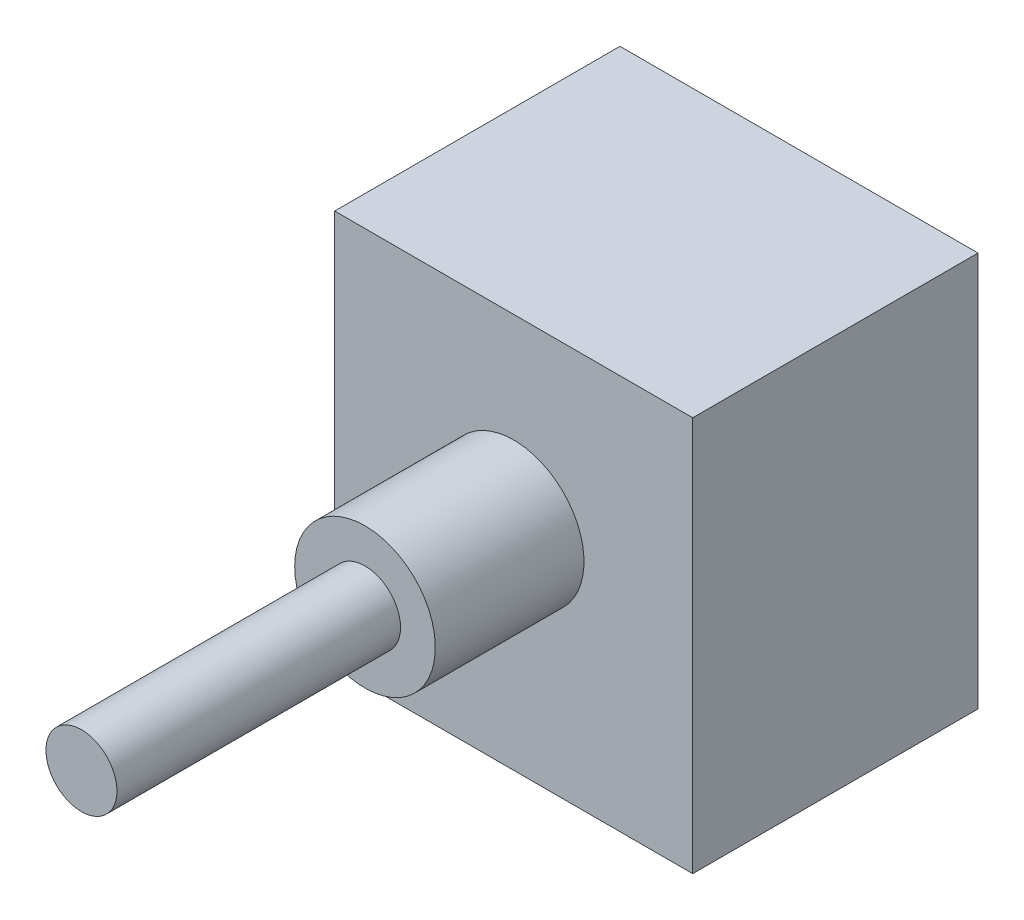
ISO-10303-21;
HEADER;
FILE_DESCRIPTION(('STEP AP214'),'2;1');
FILE_NAME('part.step','',(''),(''),'','','');
FILE_SCHEMA(('AUTOMOTIVE_DESIGN { 1 0 10303 214 1 1 1 1 }'));
ENDSEC;
DATA;
#1=APPLICATION_CONTEXT('core data for automotive mechanical design processes');
#2=APPLICATION_PROTOCOL_DEFINITION('international standard','automotive_design',2000,#1);
#3=PRODUCT_CONTEXT('',#1,'mechanical');
#4=PRODUCT('Part','Part','',(#3));
#5=PRODUCT_RELATED_PRODUCT_CATEGORY('part','',(#4));
#6=PRODUCT_DEFINITION_FORMATION('','',#4);
#7=PRODUCT_DEFINITION_CONTEXT('part definition',#1,'design');
#8=PRODUCT_DEFINITION('design','',#6,#7);
#9=PRODUCT_DEFINITION_SHAPE('','',#8);
#10=(LENGTH_UNIT() NAMED_UNIT(*) SI_UNIT(.MILLI.,.METRE.));
#11=(NAMED_UNIT(*) PLANE_ANGLE_UNIT() SI_UNIT($,.RADIAN.));
#12=(NAMED_UNIT(*) SI_UNIT($,.STERADIAN.) SOLID_ANGLE_UNIT());
#13=UNCERTAINTY_MEASURE_WITH_UNIT(LENGTH_MEASURE(1.E-05),#10,'distance_accuracy_value','');
#14=(GEOMETRIC_REPRESENTATION_CONTEXT(3) GLOBAL_UNCERTAINTY_ASSIGNED_CONTEXT((#13)) GLOBAL_UNIT_ASSIGNED_CONTEXT((#10,
#11,#12)) REPRESENTATION_CONTEXT('',''));
#15=CARTESIAN_POINT('',(0.,0.,0.));
#16=DIRECTION('',(0.,0.,1.));
#17=DIRECTION('',(1.,0.,0.));
#18=AXIS2_PLACEMENT_3D('',#15,#16,#17);
#19=CARTESIAN_POINT('',(-7.90575,-8.71855,12.5984));
#20=DIRECTION('',(1.,0.,0.));
#21=DIRECTION('',(0.,0.,-1.));
#22=AXIS2_PLACEMENT_3D('',#19,#20,#21);
#23=PLANE('',#22);
#24=DIRECTION('',(0.,-1.,0.));
#25=VECTOR('',#24,1.);
#26=CARTESIAN_POINT('',(-7.90575,-8.71855,0.));
#27=LINE('',#26,#25);
#28=CARTESIAN_POINT('',(-7.90575,8.71855,0.));
#29=VERTEX_POINT('',#28);
#30=CARTESIAN_POINT('',(-7.90575,-8.71855,0.));
#31=VERTEX_POINT('',#30);
#32=EDGE_CURVE('E98',#29,#31,#27,.T.);
#33=ORIENTED_EDGE('',*,*,#32,.T.);
#34=DIRECTION('',(0.,0.,-1.));
#35=VECTOR('',#34,1.);
#36=CARTESIAN_POINT('',(-7.90575,-8.71855,12.5984));
#37=LINE('',#36,#35);
#38=CARTESIAN_POINT('',(-7.90575,-8.71855,12.5984));
#39=VERTEX_POINT('',#38);
#40=EDGE_CURVE('E40',#39,#31,#37,.T.);
#41=ORIENTED_EDGE('',*,*,#40,.F.);
#42=DIRECTION('',(0.,-1.,0.));
#43=VECTOR('',#42,1.);
#44=CARTESIAN_POINT('',(-7.90575,-8.71855,12.5984));
#45=LINE('',#44,#43);
#46=CARTESIAN_POINT('',(-7.90575,8.71855,12.5984));
#47=VERTEX_POINT('',#46);
#48=EDGE_CURVE('E84',#47,#39,#45,.T.);
#49=ORIENTED_EDGE('',*,*,#48,.F.);
#50=DIRECTION('',(0.,0.,-1.));
#51=VECTOR('',#50,1.);
#52=CARTESIAN_POINT('',(-7.90575,8.71855,12.5984));
#53=LINE('',#52,#51);
#54=EDGE_CURVE('E94',#47,#29,#53,.T.);
#55=ORIENTED_EDGE('',*,*,#54,.T.);
#56=EDGE_LOOP('',(#33,#41,#49,#55));
#57=FACE_BOUND('',#56,.T.);
#58=ADVANCED_FACE('F32',(#57),#23,.F.);
#59=CARTESIAN_POINT('',(-7.90575,-8.71855,12.5984));
#60=DIRECTION('',(0.,1.,0.));
#61=DIRECTION('',(0.,0.,1.));
#62=AXIS2_PLACEMENT_3D('',#59,#60,#61);
#63=PLANE('',#62);
#64=DIRECTION('',(1.,0.,0.));
#65=VECTOR('',#64,1.);
#66=CARTESIAN_POINT('',(-7.90575,-8.71855,0.));
#67=LINE('',#66,#65);
#68=CARTESIAN_POINT('',(7.90575,-8.71855,0.));
#69=VERTEX_POINT('',#68);
#70=EDGE_CURVE('E89',#31,#69,#67,.T.);
#71=ORIENTED_EDGE('',*,*,#70,.T.);
#72=DIRECTION('',(0.,0.,-1.));
#73=VECTOR('',#72,1.);
#74=CARTESIAN_POINT('',(7.90575,-8.71855,12.5984));
#75=LINE('',#74,#73);
#76=CARTESIAN_POINT('',(7.90575,-8.71855,12.5984));
#77=VERTEX_POINT('',#76);
#78=EDGE_CURVE('E87',#77,#69,#75,.T.);
#79=ORIENTED_EDGE('',*,*,#78,.F.);
#80=DIRECTION('',(1.,0.,0.));
#81=VECTOR('',#80,1.);
#82=CARTESIAN_POINT('',(-7.90575,-8.71855,12.5984));
#83=LINE('',#82,#81);
#84=EDGE_CURVE('E79',#39,#77,#83,.T.);
#85=ORIENTED_EDGE('',*,*,#84,.F.);
#86=ORIENTED_EDGE('',*,*,#40,.T.);
#87=EDGE_LOOP('',(#71,#79,#85,#86));
#88=FACE_BOUND('',#87,.T.);
#89=ADVANCED_FACE('F88',(#88),#63,.F.);
#90=CARTESIAN_POINT('',(7.90575,-8.71855,12.5984));
#91=DIRECTION('',(-1.,0.,0.));
#92=DIRECTION('',(0.,0.,1.));
#93=AXIS2_PLACEMENT_3D('',#90,#91,#92);
#94=PLANE('',#93);
#95=DIRECTION('',(0.,1.,0.));
#96=VECTOR('',#95,1.);
#97=CARTESIAN_POINT('',(7.90575,-8.71855,0.));
#98=LINE('',#97,#96);
#99=CARTESIAN_POINT('',(7.90575,8.71855,0.));
#100=VERTEX_POINT('',#99);
#101=EDGE_CURVE('E65',#69,#100,#98,.T.);
#102=ORIENTED_EDGE('',*,*,#101,.T.);
#103=DIRECTION('',(0.,0.,-1.));
#104=VECTOR('',#103,1.);
#105=CARTESIAN_POINT('',(7.90575,8.71855,12.5984));
#106=LINE('',#105,#104);
#107=CARTESIAN_POINT('',(7.90575,8.71855,12.5984));
#108=VERTEX_POINT('',#107);
#109=EDGE_CURVE('E90',#108,#100,#106,.T.);
#110=ORIENTED_EDGE('',*,*,#109,.F.);
#111=DIRECTION('',(0.,1.,0.));
#112=VECTOR('',#111,1.);
#113=CARTESIAN_POINT('',(7.90575,-8.71855,12.5984));
#114=LINE('',#113,#112);
#115=EDGE_CURVE('E82',#77,#108,#114,.T.);
#116=ORIENTED_EDGE('',*,*,#115,.F.);
#117=ORIENTED_EDGE('',*,*,#78,.T.);
#118=EDGE_LOOP('',(#102,#110,#116,#117));
#119=FACE_BOUND('',#118,.T.);
#120=ADVANCED_FACE('F92',(#119),#94,.F.);
#121=CARTESIAN_POINT('',(-7.90575,8.71855,12.5984));
#122=DIRECTION('',(0.,-1.,0.));
#123=DIRECTION('',(0.,0.,-1.));
#124=AXIS2_PLACEMENT_3D('',#121,#122,#123);
#125=PLANE('',#124);
#126=DIRECTION('',(-1.,0.,0.));
#127=VECTOR('',#126,1.);
#128=CARTESIAN_POINT('',(-7.90575,8.71855,0.));
#129=LINE('',#128,#127);
#130=EDGE_CURVE('E71',#100,#29,#129,.T.);
#131=ORIENTED_EDGE('',*,*,#130,.T.);
#132=ORIENTED_EDGE('',*,*,#54,.F.);
#133=DIRECTION('',(-1.,0.,0.));
#134=VECTOR('',#133,1.);
#135=CARTESIAN_POINT('',(-7.90575,8.71855,12.5984));
#136=LINE('',#135,#134);
#137=EDGE_CURVE('E48',#108,#47,#136,.T.);
#138=ORIENTED_EDGE('',*,*,#137,.F.);
#139=ORIENTED_EDGE('',*,*,#109,.T.);
#140=EDGE_LOOP('',(#131,#132,#138,#139));
#141=FACE_BOUND('',#140,.T.);
#142=ADVANCED_FACE('F121',(#141),#125,.F.);
#143=CARTESIAN_POINT('',(0.,0.,12.5984));
#144=DIRECTION('',(0.,0.,-1.));
#145=DIRECTION('',(-1.,0.,0.));
#146=AXIS2_PLACEMENT_3D('',#143,#144,#145);
#147=PLANE('',#146);
#148=CARTESIAN_POINT('',(0.,0.812799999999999,12.5984));
#149=DIRECTION('',(0.,0.,-1.));
#150=DIRECTION('',(-1.,0.,0.));
#151=AXIS2_PLACEMENT_3D('',#148,#149,#150);
#152=CIRCLE('',#151,3.10515);
#153=CARTESIAN_POINT('',(-3.10515,0.812799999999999,12.5984));
#154=VERTEX_POINT('',#153);
#155=EDGE_CURVE('E11',#154,#154,#152,.F.);
#156=ORIENTED_EDGE('',*,*,#155,.F.);
#157=EDGE_LOOP('',(#156));
#158=FACE_BOUND('',#157,.T.);
#159=ORIENTED_EDGE('',*,*,#48,.T.);
#160=ORIENTED_EDGE('',*,*,#84,.T.);
#161=ORIENTED_EDGE('',*,*,#115,.T.);
#162=ORIENTED_EDGE('',*,*,#137,.T.);
#163=EDGE_LOOP('',(#159,#160,#161,#162));
#164=FACE_BOUND('',#163,.T.);
#165=ADVANCED_FACE('F80',(#158,#164),#147,.F.);
#166=CARTESIAN_POINT('',(0.,0.,0.));
#167=DIRECTION('',(0.,0.,-1.));
#168=DIRECTION('',(-1.,0.,0.));
#169=AXIS2_PLACEMENT_3D('',#166,#167,#168);
#170=PLANE('',#169);
#171=CARTESIAN_POINT('',(2.54,-7.62,0.));
#172=DIRECTION('',(0.,0.,-1.));
#173=DIRECTION('',(-1.,0.,0.));
#174=AXIS2_PLACEMENT_3D('',#171,#172,#173);
#175=CIRCLE('',#174,0.4445);
#176=CARTESIAN_POINT('',(2.0955,-7.62,0.));
#177=VERTEX_POINT('',#176);
#178=EDGE_CURVE('E251',#177,#177,#175,.T.);
#179=ORIENTED_EDGE('',*,*,#178,.F.);
#180=EDGE_LOOP('',(#179));
#181=FACE_BOUND('',#180,.T.);
#182=CARTESIAN_POINT('',(-2.54,-7.62,0.));
#183=DIRECTION('',(0.,0.,-1.));
#184=DIRECTION('',(-1.,0.,0.));
#185=AXIS2_PLACEMENT_3D('',#182,#183,#184);
#186=CIRCLE('',#185,0.4445);
#187=CARTESIAN_POINT('',(-2.9845,-7.62,0.));
#188=VERTEX_POINT('',#187);
#189=EDGE_CURVE('E250',#188,#188,#186,.T.);
#190=ORIENTED_EDGE('',*,*,#189,.F.);
#191=EDGE_LOOP('',(#190));
#192=FACE_BOUND('',#191,.T.);
#193=CARTESIAN_POINT('',(0.,-7.62,0.));
#194=DIRECTION('',(0.,0.,-1.));
#195=DIRECTION('',(-1.,0.,0.));
#196=AXIS2_PLACEMENT_3D('',#193,#194,#195);
#197=CIRCLE('',#196,0.444500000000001);
#198=CARTESIAN_POINT('',(-0.444500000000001,-7.62,0.));
#199=VERTEX_POINT('',#198);
#200=EDGE_CURVE('E260',#199,#199,#197,.T.);
#201=ORIENTED_EDGE('',*,*,#200,.F.);
#202=EDGE_LOOP('',(#201));
#203=FACE_BOUND('',#202,.T.);
#204=ORIENTED_EDGE('',*,*,#32,.F.);
#205=ORIENTED_EDGE('',*,*,#130,.F.);
#206=ORIENTED_EDGE('',*,*,#101,.F.);
#207=ORIENTED_EDGE('',*,*,#70,.F.);
#208=EDGE_LOOP('',(#204,#205,#206,#207));
#209=FACE_BOUND('',#208,.T.);
#210=ADVANCED_FACE('F109',(#181,#192,#203,#209),#170,.T.);
#211=CARTESIAN_POINT('',(0.,0.812799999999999,19.1643));
#212=DIRECTION('',(0.,0.,-1.));
#213=DIRECTION('',(-1.,0.,0.));
#214=AXIS2_PLACEMENT_3D('',#211,#212,#213);
#215=CYLINDRICAL_SURFACE('',#214,3.10515);
#216=CARTESIAN_POINT('',(0.,0.812799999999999,19.1643));
#217=DIRECTION('',(0.,0.,1.));
#218=DIRECTION('',(1.,0.,0.));
#219=AXIS2_PLACEMENT_3D('',#216,#217,#218);
#220=CIRCLE('',#219,3.10515);
#221=CARTESIAN_POINT('',(-3.10515,0.812799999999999,19.1643));
#222=VERTEX_POINT('',#221);
#223=EDGE_CURVE('E101',#222,#222,#220,.T.);
#224=CARTESIAN_POINT('',(-3.10515,0.812799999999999,19.1643));
#225=CARTESIAN_POINT('',(-3.10515,0.812799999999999,19.0959052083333));
#226=CARTESIAN_POINT('',(-3.10515,0.812799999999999,19.0275104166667));
#227=CARTESIAN_POINT('',(-3.10515,0.812799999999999,18.8907208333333));
#228=CARTESIAN_POINT('',(-3.10515,0.812799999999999,18.8223260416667));
#229=CARTESIAN_POINT('',(-3.10515,0.812799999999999,18.6855364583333));
#230=CARTESIAN_POINT('',(-3.10515,0.812799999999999,18.6171416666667));
#231=CARTESIAN_POINT('',(-3.10515,0.812799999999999,18.4803520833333));
#232=CARTESIAN_POINT('',(-3.10515,0.812799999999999,18.4119572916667));
#233=CARTESIAN_POINT('',(-3.10515,0.812799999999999,18.2751677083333));
#234=CARTESIAN_POINT('',(-3.10515,0.812799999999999,18.2067729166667));
#235=CARTESIAN_POINT('',(-3.10515,0.812799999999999,18.0699833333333));
#236=CARTESIAN_POINT('',(-3.10515,0.812799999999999,18.0015885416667));
#237=CARTESIAN_POINT('',(-3.10515,0.812799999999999,17.8647989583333));
#238=CARTESIAN_POINT('',(-3.10515,0.812799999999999,17.7964041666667));
#239=CARTESIAN_POINT('',(-3.10515,0.812799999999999,17.6596145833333));
#240=CARTESIAN_POINT('',(-3.10515,0.812799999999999,17.5912197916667));
#241=CARTESIAN_POINT('',(-3.10515,0.812799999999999,17.4544302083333));
#242=CARTESIAN_POINT('',(-3.10515,0.812799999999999,17.3860354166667));
#243=CARTESIAN_POINT('',(-3.10515,0.812799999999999,17.2492458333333));
#244=CARTESIAN_POINT('',(-3.10515,0.812799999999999,17.1808510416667));
#245=CARTESIAN_POINT('',(-3.10515,0.812799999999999,17.0440614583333));
#246=CARTESIAN_POINT('',(-3.10515,0.812799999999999,16.9756666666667));
#247=CARTESIAN_POINT('',(-3.10515,0.812799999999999,16.8388770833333));
#248=CARTESIAN_POINT('',(-3.10515,0.812799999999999,16.7704822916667));
#249=CARTESIAN_POINT('',(-3.10515,0.812799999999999,16.6336927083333));
#250=CARTESIAN_POINT('',(-3.10515,0.812799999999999,16.5652979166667));
#251=CARTESIAN_POINT('',(-3.10515,0.812799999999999,16.4285083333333));
#252=CARTESIAN_POINT('',(-3.10515,0.812799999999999,16.3601135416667));
#253=CARTESIAN_POINT('',(-3.10515,0.812799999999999,16.2233239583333));
#254=CARTESIAN_POINT('',(-3.10515,0.812799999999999,16.1549291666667));
#255=CARTESIAN_POINT('',(-3.10515,0.812799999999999,16.0181395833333));
#256=CARTESIAN_POINT('',(-3.10515,0.812799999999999,15.9497447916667));
#257=CARTESIAN_POINT('',(-3.10515,0.812799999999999,15.8129552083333));
#258=CARTESIAN_POINT('',(-3.10515,0.812799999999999,15.7445604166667));
#259=CARTESIAN_POINT('',(-3.10515,0.812799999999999,15.6077708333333));
#260=CARTESIAN_POINT('',(-3.10515,0.812799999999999,15.5393760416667));
#261=CARTESIAN_POINT('',(-3.10515,0.812799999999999,15.4025864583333));
#262=CARTESIAN_POINT('',(-3.10515,0.812799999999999,15.3341916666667));
#263=CARTESIAN_POINT('',(-3.10515,0.812799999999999,15.1974020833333));
#264=CARTESIAN_POINT('',(-3.10515,0.812799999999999,15.1290072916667));
#265=CARTESIAN_POINT('',(-3.10515,0.812799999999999,14.9922177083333));
#266=CARTESIAN_POINT('',(-3.10515,0.812799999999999,14.9238229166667));
#267=CARTESIAN_POINT('',(-3.10515,0.812799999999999,14.7870333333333));
#268=CARTESIAN_POINT('',(-3.10515,0.812799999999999,14.7186385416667));
#269=CARTESIAN_POINT('',(-3.10515,0.812799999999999,14.5818489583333));
#270=CARTESIAN_POINT('',(-3.10515,0.812799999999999,14.5134541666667));
#271=CARTESIAN_POINT('',(-3.10515,0.812799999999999,14.3766645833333));
#272=CARTESIAN_POINT('',(-3.10515,0.812799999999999,14.3082697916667));
#273=CARTESIAN_POINT('',(-3.10515,0.812799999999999,14.1714802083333));
#274=CARTESIAN_POINT('',(-3.10515,0.812799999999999,14.1030854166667));
#275=CARTESIAN_POINT('',(-3.10515,0.812799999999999,13.9662958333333));
#276=CARTESIAN_POINT('',(-3.10515,0.812799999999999,13.8979010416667));
#277=CARTESIAN_POINT('',(-3.10515,0.812799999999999,13.7611114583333));
#278=CARTESIAN_POINT('',(-3.10515,0.812799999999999,13.6927166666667));
#279=CARTESIAN_POINT('',(-3.10515,0.812799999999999,13.5559270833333));
#280=CARTESIAN_POINT('',(-3.10515,0.812799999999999,13.4875322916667));
#281=CARTESIAN_POINT('',(-3.10515,0.812799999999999,13.3507427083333));
#282=CARTESIAN_POINT('',(-3.10515,0.812799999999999,13.2823479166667));
#283=CARTESIAN_POINT('',(-3.10515,0.812799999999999,13.1455583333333));
#284=CARTESIAN_POINT('',(-3.10515,0.812799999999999,13.0771635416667));
#285=CARTESIAN_POINT('',(-3.10515,0.812799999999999,12.9403739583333));
#286=CARTESIAN_POINT('',(-3.10515,0.812799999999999,12.8719791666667));
#287=CARTESIAN_POINT('',(-3.10515,0.812799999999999,12.7351895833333));
#288=CARTESIAN_POINT('',(-3.10515,0.812799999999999,12.6667947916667));
#289=CARTESIAN_POINT('',(-3.10515,0.812799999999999,12.5984));
#290=B_SPLINE_CURVE_WITH_KNOTS('',3,(#224,#225,#226,#227,#228,#229,#230,#231,#232,#233,#234,
#235,#236,#237,#238,#239,#240,#241,#242,#243,#244,#245,#246,#247,#248,#249,#250,#251,#252,#253,
#254,#255,#256,#257,#258,#259,#260,#261,#262,#263,#264,#265,#266,#267,#268,#269,#270,#271,#272,
#273,#274,#275,#276,#277,#278,#279,#280,#281,#282,#283,#284,#285,#286,#287,#288,#289),
.UNSPECIFIED.,.F.,.F.,(4,2,2,2,2,2,2,2,2,2,2,2,2,2,2,2,2,2,2,2,2,2,2,2,2,2,2,2,2,2,2,2,4),(0.,
0.205184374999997,0.410368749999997,0.615553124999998,0.820737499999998,1.025921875,1.23110625,
1.436290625,1.641475,1.846659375,2.05184375,2.257028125,2.4622125,2.667396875,2.87258125,
3.077765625,3.28295,3.488134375,3.69331875,3.898503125,4.1036875,4.308871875,4.51405624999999,
4.719240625,4.924425,5.129609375,5.33479374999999,5.539978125,5.74516249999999,5.95034687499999,
6.15553124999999,6.360715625,6.5659),.UNSPECIFIED.);
#291=EDGE_CURVE('BSEAM111',#222,#154,#290,.T.);
#292=ORIENTED_EDGE('',*,*,#223,.F.);
#293=ORIENTED_EDGE('',*,*,#155,.T.);
#294=ORIENTED_EDGE('',*,*,#291,.T.);
#295=ORIENTED_EDGE('',*,*,#291,.F.);
#296=EDGE_LOOP('',(#292,#294,#293,#295));
#297=FACE_BOUND('',#296,.T.);
#298=ADVANCED_FACE('F111',(#297),#215,.T.);
#299=CARTESIAN_POINT('',(0.,0.812799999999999,19.1643));
#300=DIRECTION('',(0.,0.,1.));
#301=DIRECTION('',(1.,0.,0.));
#302=AXIS2_PLACEMENT_3D('',#299,#300,#301);
#303=PLANE('',#302);
#304=CARTESIAN_POINT('',(0.,0.812799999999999,19.1643));
#305=DIRECTION('',(0.,0.,1.));
#306=DIRECTION('',(1.,0.,0.));
#307=AXIS2_PLACEMENT_3D('',#304,#305,#306);
#308=CIRCLE('',#307,1.56845);
#309=CARTESIAN_POINT('',(1.56845,0.812799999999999,19.1643));
#310=VERTEX_POINT('',#309);
#311=EDGE_CURVE('E265',#310,#310,#308,.T.);
#312=ORIENTED_EDGE('',*,*,#311,.F.);
#313=EDGE_LOOP('',(#312));
#314=FACE_BOUND('',#313,.T.);
#315=ORIENTED_EDGE('',*,*,#223,.T.);
#316=EDGE_LOOP('',(#315));
#317=FACE_BOUND('',#316,.T.);
#318=ADVANCED_FACE('F118',(#314,#317),#303,.T.);
#319=CARTESIAN_POINT('',(0.,0.812799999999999,31.6865));
#320=DIRECTION('',(0.,0.,-1.));
#321=DIRECTION('',(-1.,0.,0.));
#322=AXIS2_PLACEMENT_3D('',#319,#320,#321);
#323=CYLINDRICAL_SURFACE('',#322,1.56845);
#324=CARTESIAN_POINT('',(0.,0.812799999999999,31.6865));
#325=DIRECTION('',(0.,0.,1.));
#326=DIRECTION('',(1.,0.,0.));
#327=AXIS2_PLACEMENT_3D('',#324,#325,#326);
#328=CIRCLE('',#327,1.56845);
#329=CARTESIAN_POINT('',(1.56845,0.812799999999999,31.6865));
#330=VERTEX_POINT('',#329);
#331=EDGE_CURVE('E268',#330,#330,#328,.T.);
#332=ORIENTED_EDGE('',*,*,#331,.F.);
#333=EDGE_LOOP('',(#332));
#334=FACE_BOUND('',#333,.T.);
#335=ORIENTED_EDGE('',*,*,#311,.T.);
#336=EDGE_LOOP('',(#335));
#337=FACE_BOUND('',#336,.T.);
#338=ADVANCED_FACE('F160',(#334,#337),#323,.T.);
#339=CARTESIAN_POINT('',(0.,0.812799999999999,31.6865));
#340=DIRECTION('',(0.,0.,1.));
#341=DIRECTION('',(1.,0.,0.));
#342=AXIS2_PLACEMENT_3D('',#339,#340,#341);
#343=PLANE('',#342);
#344=ORIENTED_EDGE('',*,*,#331,.T.);
#345=EDGE_LOOP('',(#344));
#346=FACE_BOUND('',#345,.T.);
#347=ADVANCED_FACE('F170',(#346),#343,.T.);
#348=CARTESIAN_POINT('',(0.,-7.62,-1.016));
#349=DIRECTION('',(0.,0.,1.));
#350=DIRECTION('',(1.,0.,0.));
#351=AXIS2_PLACEMENT_3D('',#348,#349,#350);
#352=CYLINDRICAL_SURFACE('',#351,0.444500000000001);
#353=CARTESIAN_POINT('',(0.,-7.62,-1.016));
#354=DIRECTION('',(0.,0.,-1.));
#355=DIRECTION('',(-1.,0.,0.));
#356=AXIS2_PLACEMENT_3D('',#353,#354,#355);
#357=CIRCLE('',#356,0.444500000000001);
#358=CARTESIAN_POINT('',(-0.444500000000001,-7.62,-1.016));
#359=VERTEX_POINT('',#358);
#360=EDGE_CURVE('E262',#359,#359,#357,.T.);
#361=ORIENTED_EDGE('',*,*,#360,.F.);
#362=EDGE_LOOP('',(#361));
#363=FACE_BOUND('',#362,.T.);
#364=ORIENTED_EDGE('',*,*,#200,.T.);
#365=EDGE_LOOP('',(#364));
#366=FACE_BOUND('',#365,.T.);
#367=ADVANCED_FACE('F179',(#363,#366),#352,.T.);
#368=CARTESIAN_POINT('',(0.,-7.62,-1.016));
#369=DIRECTION('',(0.,0.,-1.));
#370=DIRECTION('',(-1.,0.,0.));
#371=AXIS2_PLACEMENT_3D('',#368,#369,#370);
#372=PLANE('',#371);
#373=ORIENTED_EDGE('',*,*,#360,.T.);
#374=EDGE_LOOP('',(#373));
#375=FACE_BOUND('',#374,.T.);
#376=ADVANCED_FACE('F193',(#375),#372,.T.);
#377=CARTESIAN_POINT('',(-2.54,-7.62,-1.016));
#378=DIRECTION('',(0.,0.,1.));
#379=DIRECTION('',(1.,0.,0.));
#380=AXIS2_PLACEMENT_3D('',#377,#378,#379);
#381=CYLINDRICAL_SURFACE('',#380,0.4445);
#382=CARTESIAN_POINT('',(-2.54,-7.62,-1.016));
#383=DIRECTION('',(0.,0.,-1.));
#384=DIRECTION('',(-1.,0.,0.));
#385=AXIS2_PLACEMENT_3D('',#382,#383,#384);
#386=CIRCLE('',#385,0.4445);
#387=CARTESIAN_POINT('',(-2.9845,-7.62,-1.016));
#388=VERTEX_POINT('',#387);
#389=EDGE_CURVE('E254',#388,#388,#386,.T.);
#390=ORIENTED_EDGE('',*,*,#389,.F.);
#391=EDGE_LOOP('',(#390));
#392=FACE_BOUND('',#391,.T.);
#393=ORIENTED_EDGE('',*,*,#189,.T.);
#394=EDGE_LOOP('',(#393));
#395=FACE_BOUND('',#394,.T.);
#396=ADVANCED_FACE('F203',(#392,#395),#381,.T.);
#397=CARTESIAN_POINT('',(-2.54,-7.62,-1.016));
#398=DIRECTION('',(0.,0.,-1.));
#399=DIRECTION('',(-1.,0.,0.));
#400=AXIS2_PLACEMENT_3D('',#397,#398,#399);
#401=PLANE('',#400);
#402=ORIENTED_EDGE('',*,*,#389,.T.);
#403=EDGE_LOOP('',(#402));
#404=FACE_BOUND('',#403,.T.);
#405=ADVANCED_FACE('F213',(#404),#401,.T.);
#406=CARTESIAN_POINT('',(2.54,-7.62,-1.016));
#407=DIRECTION('',(0.,0.,1.));
#408=DIRECTION('',(1.,0.,0.));
#409=AXIS2_PLACEMENT_3D('',#406,#407,#408);
#410=CYLINDRICAL_SURFACE('',#409,0.4445);
#411=CARTESIAN_POINT('',(2.54,-7.62,-1.016));
#412=DIRECTION('',(0.,0.,-1.));
#413=DIRECTION('',(-1.,0.,0.));
#414=AXIS2_PLACEMENT_3D('',#411,#412,#413);
#415=CIRCLE('',#414,0.4445);
#416=CARTESIAN_POINT('',(2.0955,-7.62,-1.016));
#417=VERTEX_POINT('',#416);
#418=EDGE_CURVE('E249',#417,#417,#415,.T.);
#419=ORIENTED_EDGE('',*,*,#418,.F.);
#420=EDGE_LOOP('',(#419));
#421=FACE_BOUND('',#420,.T.);
#422=ORIENTED_EDGE('',*,*,#178,.T.);
#423=EDGE_LOOP('',(#422));
#424=FACE_BOUND('',#423,.T.);
#425=ADVANCED_FACE('F223',(#421,#424),#410,.T.);
#426=CARTESIAN_POINT('',(2.54,-7.62,-1.016));
#427=DIRECTION('',(0.,0.,-1.));
#428=DIRECTION('',(-1.,0.,0.));
#429=AXIS2_PLACEMENT_3D('',#426,#427,#428);
#430=PLANE('',#429);
#431=ORIENTED_EDGE('',*,*,#418,.T.);
#432=EDGE_LOOP('',(#431));
#433=FACE_BOUND('',#432,.T.);
#434=ADVANCED_FACE('F233',(#433),#430,.T.);
#435=CLOSED_SHELL('',(#58,#89,#120,#142,#165,#210,#298,#318,#338,#347,#367,#376,#396,#405,#425,#434));
#436=MANIFOLD_SOLID_BREP('B2',#435);
#437=ADVANCED_BREP_SHAPE_REPRESENTATION('',(#18,#436),#14);
#438=SHAPE_DEFINITION_REPRESENTATION(#9,#437);
ENDSEC;
END-ISO-10303-21;
